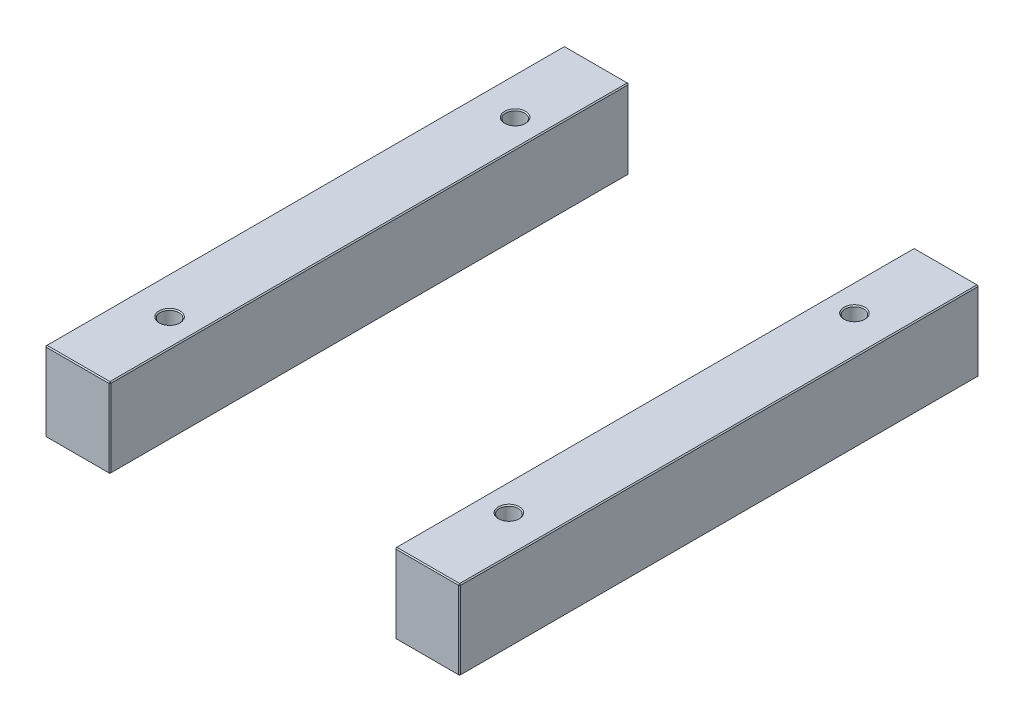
ISO-10303-21;
HEADER;
FILE_DESCRIPTION(('STEP AP214'),'2;1');
FILE_NAME('part.step','',(''),(''),'','','');
FILE_SCHEMA(('AUTOMOTIVE_DESIGN { 1 0 10303 214 1 1 1 1 }'));
ENDSEC;
DATA;
#1=APPLICATION_CONTEXT('core data for automotive mechanical design processes');
#2=APPLICATION_PROTOCOL_DEFINITION('international standard','automotive_design',2000,#1);
#3=PRODUCT_CONTEXT('',#1,'mechanical');
#4=PRODUCT('Part','Part','',(#3));
#5=PRODUCT_RELATED_PRODUCT_CATEGORY('part','',(#4));
#6=PRODUCT_DEFINITION_FORMATION('','',#4);
#7=PRODUCT_DEFINITION_CONTEXT('part definition',#1,'design');
#8=PRODUCT_DEFINITION('design','',#6,#7);
#9=PRODUCT_DEFINITION_SHAPE('','',#8);
#10=(LENGTH_UNIT() NAMED_UNIT(*) SI_UNIT(.MILLI.,.METRE.));
#11=(NAMED_UNIT(*) PLANE_ANGLE_UNIT() SI_UNIT($,.RADIAN.));
#12=(NAMED_UNIT(*) SI_UNIT($,.STERADIAN.) SOLID_ANGLE_UNIT());
#13=UNCERTAINTY_MEASURE_WITH_UNIT(LENGTH_MEASURE(1.E-05),#10,'distance_accuracy_value','');
#14=(GEOMETRIC_REPRESENTATION_CONTEXT(3) GLOBAL_UNCERTAINTY_ASSIGNED_CONTEXT((#13)) GLOBAL_UNIT_ASSIGNED_CONTEXT((#10,
#11,#12)) REPRESENTATION_CONTEXT('',''));
#15=CARTESIAN_POINT('',(0.,0.,0.));
#16=DIRECTION('',(0.,0.,1.));
#17=DIRECTION('',(1.,0.,0.));
#18=AXIS2_PLACEMENT_3D('',#15,#16,#17);
#19=CARTESIAN_POINT('',(-198.,76.,-248.));
#20=DIRECTION('',(0.,0.,1.));
#21=DIRECTION('',(1.,0.,0.));
#22=AXIS2_PLACEMENT_3D('',#19,#20,#21);
#23=PLANE('',#22);
#24=DIRECTION('',(-1.,0.,0.));
#25=VECTOR('',#24,1.);
#26=CARTESIAN_POINT('',(-198.,1.00000000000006,-248.));
#27=LINE('',#26,#25);
#28=CARTESIAN_POINT('',(-137.,1.00000000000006,-248.));
#29=VERTEX_POINT('',#28);
#30=CARTESIAN_POINT('',(-197.,1.00000000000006,-248.));
#31=VERTEX_POINT('',#30);
#32=EDGE_CURVE('P0_E137',#29,#31,#27,.T.);
#33=ORIENTED_EDGE('',*,*,#32,.T.);
#34=DIRECTION('',(0.,1.,0.));
#35=VECTOR('',#34,1.);
#36=CARTESIAN_POINT('',(-197.,76.,-248.));
#37=LINE('',#36,#35);
#38=CARTESIAN_POINT('',(-197.,75.,-248.));
#39=VERTEX_POINT('',#38);
#40=EDGE_CURVE('P0_E235',#31,#39,#37,.T.);
#41=ORIENTED_EDGE('',*,*,#40,.T.);
#42=DIRECTION('',(1.,0.,0.));
#43=VECTOR('',#42,1.);
#44=CARTESIAN_POINT('',(-198.,75.,-248.));
#45=LINE('',#44,#43);
#46=CARTESIAN_POINT('',(-137.,75.,-248.));
#47=VERTEX_POINT('',#46);
#48=EDGE_CURVE('P0_E233',#39,#47,#45,.T.);
#49=ORIENTED_EDGE('',*,*,#48,.T.);
#50=DIRECTION('',(0.,-1.,0.));
#51=VECTOR('',#50,1.);
#52=CARTESIAN_POINT('',(-137.,76.,-248.));
#53=LINE('',#52,#51);
#54=EDGE_CURVE('P0_E230',#47,#29,#53,.T.);
#55=ORIENTED_EDGE('',*,*,#54,.T.);
#56=EDGE_LOOP('',(#33,#41,#49,#55));
#57=FACE_BOUND('',#56,.T.);
#58=ADVANCED_FACE('P0_F16',(#57),#23,.F.);
#59=CARTESIAN_POINT('',(-198.,76.,248.));
#60=DIRECTION('',(1.,0.,0.));
#61=DIRECTION('',(0.,0.,-1.));
#62=AXIS2_PLACEMENT_3D('',#59,#60,#61);
#63=PLANE('',#62);
#64=DIRECTION('',(0.,1.,0.));
#65=VECTOR('',#64,1.);
#66=CARTESIAN_POINT('',(-198.,76.,247.));
#67=LINE('',#66,#65);
#68=CARTESIAN_POINT('',(-198.,1.00000000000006,247.));
#69=VERTEX_POINT('',#68);
#70=CARTESIAN_POINT('',(-198.,75.,247.));
#71=VERTEX_POINT('',#70);
#72=EDGE_CURVE('P0_E217',#69,#71,#67,.T.);
#73=ORIENTED_EDGE('',*,*,#72,.T.);
#74=DIRECTION('',(0.,0.,-1.));
#75=VECTOR('',#74,1.);
#76=CARTESIAN_POINT('',(-198.,75.,248.));
#77=LINE('',#76,#75);
#78=CARTESIAN_POINT('',(-198.,75.,-247.));
#79=VERTEX_POINT('',#78);
#80=EDGE_CURVE('P0_E228',#71,#79,#77,.T.);
#81=ORIENTED_EDGE('',*,*,#80,.T.);
#82=DIRECTION('',(0.,-1.,0.));
#83=VECTOR('',#82,1.);
#84=CARTESIAN_POINT('',(-198.,76.,-247.));
#85=LINE('',#84,#83);
#86=CARTESIAN_POINT('',(-198.,1.00000000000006,-247.));
#87=VERTEX_POINT('',#86);
#88=EDGE_CURVE('P0_E225',#79,#87,#85,.T.);
#89=ORIENTED_EDGE('',*,*,#88,.T.);
#90=DIRECTION('',(0.,0.,1.));
#91=VECTOR('',#90,1.);
#92=CARTESIAN_POINT('',(-198.,1.00000000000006,248.));
#93=LINE('',#92,#91);
#94=EDGE_CURVE('P0_E214',#87,#69,#93,.T.);
#95=ORIENTED_EDGE('',*,*,#94,.T.);
#96=EDGE_LOOP('',(#73,#81,#89,#95));
#97=FACE_BOUND('',#96,.T.);
#98=ADVANCED_FACE('P0_F302',(#97),#63,.F.);
#99=CARTESIAN_POINT('',(-198.,76.,248.));
#100=DIRECTION('',(0.,0.,-1.));
#101=DIRECTION('',(-1.,0.,0.));
#102=AXIS2_PLACEMENT_3D('',#99,#100,#101);
#103=PLANE('',#102);
#104=DIRECTION('',(-1.,0.,0.));
#105=VECTOR('',#104,1.);
#106=CARTESIAN_POINT('',(-198.,75.,248.));
#107=LINE('',#106,#105);
#108=CARTESIAN_POINT('',(-137.,75.,248.));
#109=VERTEX_POINT('',#108);
#110=CARTESIAN_POINT('',(-197.,75.,248.));
#111=VERTEX_POINT('',#110);
#112=EDGE_CURVE('P0_E242',#109,#111,#107,.T.);
#113=ORIENTED_EDGE('',*,*,#112,.T.);
#114=DIRECTION('',(0.,-1.,0.));
#115=VECTOR('',#114,1.);
#116=CARTESIAN_POINT('',(-197.,76.,248.));
#117=LINE('',#116,#115);
#118=CARTESIAN_POINT('',(-197.,1.00000000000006,248.));
#119=VERTEX_POINT('',#118);
#120=EDGE_CURVE('P0_E244',#111,#119,#117,.T.);
#121=ORIENTED_EDGE('',*,*,#120,.T.);
#122=DIRECTION('',(1.,0.,0.));
#123=VECTOR('',#122,1.);
#124=CARTESIAN_POINT('',(-136.,1.00000000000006,248.));
#125=LINE('',#124,#123);
#126=CARTESIAN_POINT('',(-137.,1.00000000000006,248.));
#127=VERTEX_POINT('',#126);
#128=EDGE_CURVE('P0_E240',#119,#127,#125,.T.);
#129=ORIENTED_EDGE('',*,*,#128,.T.);
#130=DIRECTION('',(0.,1.,0.));
#131=VECTOR('',#130,1.);
#132=CARTESIAN_POINT('',(-137.,76.,248.));
#133=LINE('',#132,#131);
#134=EDGE_CURVE('P0_E238',#127,#109,#133,.T.);
#135=ORIENTED_EDGE('',*,*,#134,.T.);
#136=EDGE_LOOP('',(#113,#121,#129,#135));
#137=FACE_BOUND('',#136,.T.);
#138=ADVANCED_FACE('P0_F341',(#137),#103,.F.);
#139=CARTESIAN_POINT('',(-136.,76.,-248.));
#140=DIRECTION('',(-1.,0.,0.));
#141=DIRECTION('',(0.,0.,1.));
#142=AXIS2_PLACEMENT_3D('',#139,#140,#141);
#143=PLANE('',#142);
#144=DIRECTION('',(0.,0.,1.));
#145=VECTOR('',#144,1.);
#146=CARTESIAN_POINT('',(-136.,75.,-248.));
#147=LINE('',#146,#145);
#148=CARTESIAN_POINT('',(-136.,75.,-247.));
#149=VERTEX_POINT('',#148);
#150=CARTESIAN_POINT('',(-136.,75.,247.));
#151=VERTEX_POINT('',#150);
#152=EDGE_CURVE('P0_E31',#149,#151,#147,.T.);
#153=ORIENTED_EDGE('',*,*,#152,.T.);
#154=DIRECTION('',(0.,-1.,0.));
#155=VECTOR('',#154,1.);
#156=CARTESIAN_POINT('',(-136.,76.,247.));
#157=LINE('',#156,#155);
#158=CARTESIAN_POINT('',(-136.,1.00000000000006,247.));
#159=VERTEX_POINT('',#158);
#160=EDGE_CURVE('P0_E190',#151,#159,#157,.T.);
#161=ORIENTED_EDGE('',*,*,#160,.T.);
#162=DIRECTION('',(0.,0.,-1.));
#163=VECTOR('',#162,1.);
#164=CARTESIAN_POINT('',(-136.,1.00000000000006,-248.));
#165=LINE('',#164,#163);
#166=CARTESIAN_POINT('',(-136.,1.00000000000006,-247.));
#167=VERTEX_POINT('',#166);
#168=EDGE_CURVE('P0_E256',#159,#167,#165,.T.);
#169=ORIENTED_EDGE('',*,*,#168,.T.);
#170=DIRECTION('',(0.,1.,0.));
#171=VECTOR('',#170,1.);
#172=CARTESIAN_POINT('',(-136.,76.,-247.));
#173=LINE('',#172,#171);
#174=EDGE_CURVE('P0_E36',#167,#149,#173,.T.);
#175=ORIENTED_EDGE('',*,*,#174,.T.);
#176=EDGE_LOOP('',(#153,#161,#169,#175));
#177=FACE_BOUND('',#176,.T.);
#178=ADVANCED_FACE('P0_F535',(#177),#143,.F.);
#179=CARTESIAN_POINT('',(0.,76.,0.));
#180=DIRECTION('',(0.,-1.,0.));
#181=DIRECTION('',(0.,0.,-1.));
#182=AXIS2_PLACEMENT_3D('',#179,#180,#181);
#183=PLANE('',#182);
#184=CARTESIAN_POINT('',(-162.,76.,165.));
#185=DIRECTION('',(0.,-1.,0.));
#186=DIRECTION('',(0.,0.,-1.));
#187=AXIS2_PLACEMENT_3D('',#184,#185,#186);
#188=CIRCLE('',#187,10.);
#189=CARTESIAN_POINT('',(-162.,76.,155.));
#190=VERTEX_POINT('',#189);
#191=EDGE_CURVE('P0_E24',#190,#190,#188,.T.);
#192=ORIENTED_EDGE('',*,*,#191,.T.);
#193=EDGE_LOOP('',(#192));
#194=FACE_BOUND('',#193,.T.);
#195=CARTESIAN_POINT('',(-162.,76.,-165.));
#196=DIRECTION('',(0.,-1.,0.));
#197=DIRECTION('',(0.,0.,-1.));
#198=AXIS2_PLACEMENT_3D('',#195,#196,#197);
#199=CIRCLE('',#198,10.);
#200=CARTESIAN_POINT('',(-162.,76.,-175.));
#201=VERTEX_POINT('',#200);
#202=EDGE_CURVE('P0_E189',#201,#201,#199,.T.);
#203=ORIENTED_EDGE('',*,*,#202,.T.);
#204=EDGE_LOOP('',(#203));
#205=FACE_BOUND('',#204,.T.);
#206=DIRECTION('',(0.,0.,1.));
#207=VECTOR('',#206,1.);
#208=CARTESIAN_POINT('',(-197.,76.,0.));
#209=LINE('',#208,#207);
#210=CARTESIAN_POINT('',(-197.,76.,-247.));
#211=VERTEX_POINT('',#210);
#212=CARTESIAN_POINT('',(-197.,76.,247.));
#213=VERTEX_POINT('',#212);
#214=EDGE_CURVE('P0_E251',#211,#213,#209,.T.);
#215=ORIENTED_EDGE('',*,*,#214,.T.);
#216=DIRECTION('',(1.,0.,0.));
#217=VECTOR('',#216,1.);
#218=CARTESIAN_POINT('',(0.,76.,247.));
#219=LINE('',#218,#217);
#220=CARTESIAN_POINT('',(-137.,76.,247.));
#221=VERTEX_POINT('',#220);
#222=EDGE_CURVE('P0_E253',#213,#221,#219,.T.);
#223=ORIENTED_EDGE('',*,*,#222,.T.);
#224=DIRECTION('',(0.,0.,-1.));
#225=VECTOR('',#224,1.);
#226=CARTESIAN_POINT('',(-137.,76.,0.));
#227=LINE('',#226,#225);
#228=CARTESIAN_POINT('',(-137.,76.,-247.));
#229=VERTEX_POINT('',#228);
#230=EDGE_CURVE('P0_E247',#221,#229,#227,.T.);
#231=ORIENTED_EDGE('',*,*,#230,.T.);
#232=DIRECTION('',(-1.,0.,0.));
#233=VECTOR('',#232,1.);
#234=CARTESIAN_POINT('',(0.,76.,-247.));
#235=LINE('',#234,#233);
#236=EDGE_CURVE('P0_E249',#229,#211,#235,.T.);
#237=ORIENTED_EDGE('',*,*,#236,.T.);
#238=EDGE_LOOP('',(#215,#223,#231,#237));
#239=FACE_BOUND('',#238,.T.);
#240=ADVANCED_FACE('P0_F195',(#194,#205,#239),#183,.F.);
#241=CARTESIAN_POINT('',(0.,0.,0.));
#242=DIRECTION('',(0.,-1.,0.));
#243=DIRECTION('',(0.,0.,-1.));
#244=AXIS2_PLACEMENT_3D('',#241,#242,#243);
#245=PLANE('',#244);
#246=CARTESIAN_POINT('',(-162.,0.,-165.));
#247=DIRECTION('',(0.,-1.,0.));
#248=DIRECTION('',(0.,0.,-1.));
#249=AXIS2_PLACEMENT_3D('',#246,#247,#248);
#250=CIRCLE('',#249,10.);
#251=CARTESIAN_POINT('',(-162.,0.,-175.));
#252=VERTEX_POINT('',#251);
#253=EDGE_CURVE('P0_E220',#252,#252,#250,.F.);
#254=ORIENTED_EDGE('',*,*,#253,.T.);
#255=EDGE_LOOP('',(#254));
#256=FACE_BOUND('',#255,.T.);
#257=CARTESIAN_POINT('',(-162.,0.,165.));
#258=DIRECTION('',(0.,-1.,0.));
#259=DIRECTION('',(0.,0.,-1.));
#260=AXIS2_PLACEMENT_3D('',#257,#258,#259);
#261=CIRCLE('',#260,10.);
#262=CARTESIAN_POINT('',(-162.,0.,155.));
#263=VERTEX_POINT('',#262);
#264=EDGE_CURVE('P0_E608',#263,#263,#261,.F.);
#265=ORIENTED_EDGE('',*,*,#264,.T.);
#266=EDGE_LOOP('',(#265));
#267=FACE_BOUND('',#266,.T.);
#268=DIRECTION('',(-1.,0.,0.));
#269=VECTOR('',#268,1.);
#270=CARTESIAN_POINT('',(-198.,0.,247.));
#271=LINE('',#270,#269);
#272=CARTESIAN_POINT('',(-137.,0.,247.));
#273=VERTEX_POINT('',#272);
#274=CARTESIAN_POINT('',(-197.,0.,247.));
#275=VERTEX_POINT('',#274);
#276=EDGE_CURVE('P0_E114',#273,#275,#271,.T.);
#277=ORIENTED_EDGE('',*,*,#276,.T.);
#278=DIRECTION('',(0.,0.,-1.));
#279=VECTOR('',#278,1.);
#280=CARTESIAN_POINT('',(-197.,0.,-248.));
#281=LINE('',#280,#279);
#282=CARTESIAN_POINT('',(-197.,0.,-247.));
#283=VERTEX_POINT('',#282);
#284=EDGE_CURVE('P0_E110',#275,#283,#281,.T.);
#285=ORIENTED_EDGE('',*,*,#284,.T.);
#286=DIRECTION('',(1.,0.,0.));
#287=VECTOR('',#286,1.);
#288=CARTESIAN_POINT('',(-136.,0.,-247.));
#289=LINE('',#288,#287);
#290=CARTESIAN_POINT('',(-137.,0.,-247.));
#291=VERTEX_POINT('',#290);
#292=EDGE_CURVE('P0_E104',#283,#291,#289,.T.);
#293=ORIENTED_EDGE('',*,*,#292,.T.);
#294=DIRECTION('',(0.,0.,1.));
#295=VECTOR('',#294,1.);
#296=CARTESIAN_POINT('',(-137.,0.,248.));
#297=LINE('',#296,#295);
#298=EDGE_CURVE('P0_E107',#291,#273,#297,.T.);
#299=ORIENTED_EDGE('',*,*,#298,.T.);
#300=EDGE_LOOP('',(#277,#285,#293,#299));
#301=FACE_BOUND('',#300,.T.);
#302=ADVANCED_FACE('P0_F106',(#256,#267,#301),#245,.T.);
#303=CARTESIAN_POINT('',(-162.,0.,-165.));
#304=DIRECTION('',(0.,1.,0.));
#305=DIRECTION('',(0.,0.,1.));
#306=AXIS2_PLACEMENT_3D('',#303,#304,#305);
#307=CYLINDRICAL_SURFACE('',#306,9.);
#308=CARTESIAN_POINT('',(-162.,75.,-165.));
#309=DIRECTION('',(0.,-1.,0.));
#310=DIRECTION('',(0.,0.,-1.));
#311=AXIS2_PLACEMENT_3D('',#308,#309,#310);
#312=CIRCLE('',#311,9.);
#313=CARTESIAN_POINT('',(-162.,75.,-174.));
#314=VERTEX_POINT('',#313);
#315=EDGE_CURVE('P0_E10',#314,#314,#312,.F.);
#316=ORIENTED_EDGE('',*,*,#315,.T.);
#317=EDGE_LOOP('',(#316));
#318=FACE_BOUND('',#317,.T.);
#319=CARTESIAN_POINT('',(-162.,0.999999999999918,-165.));
#320=DIRECTION('',(0.,-1.,0.));
#321=DIRECTION('',(0.,0.,-1.));
#322=AXIS2_PLACEMENT_3D('',#319,#320,#321);
#323=CIRCLE('',#322,9.);
#324=CARTESIAN_POINT('',(-162.,0.999999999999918,-174.));
#325=VERTEX_POINT('',#324);
#326=EDGE_CURVE('P0_E215',#325,#325,#323,.T.);
#327=ORIENTED_EDGE('',*,*,#326,.T.);
#328=EDGE_LOOP('',(#327));
#329=FACE_BOUND('',#328,.T.);
#330=ADVANCED_FACE('P0_F208',(#318,#329),#307,.F.);
#331=CARTESIAN_POINT('',(-162.,0.,165.));
#332=DIRECTION('',(0.,1.,0.));
#333=DIRECTION('',(0.,0.,1.));
#334=AXIS2_PLACEMENT_3D('',#331,#332,#333);
#335=CYLINDRICAL_SURFACE('',#334,9.);
#336=CARTESIAN_POINT('',(-162.,75.,165.));
#337=DIRECTION('',(0.,-1.,0.));
#338=DIRECTION('',(0.,0.,-1.));
#339=AXIS2_PLACEMENT_3D('',#336,#337,#338);
#340=CIRCLE('',#339,9.);
#341=CARTESIAN_POINT('',(-162.,75.,156.));
#342=VERTEX_POINT('',#341);
#343=EDGE_CURVE('P0_E186',#342,#342,#340,.F.);
#344=ORIENTED_EDGE('',*,*,#343,.T.);
#345=EDGE_LOOP('',(#344));
#346=FACE_BOUND('',#345,.T.);
#347=CARTESIAN_POINT('',(-162.,0.999999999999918,165.));
#348=DIRECTION('',(0.,-1.,0.));
#349=DIRECTION('',(0.,0.,-1.));
#350=AXIS2_PLACEMENT_3D('',#347,#348,#349);
#351=CIRCLE('',#350,9.);
#352=CARTESIAN_POINT('',(-162.,0.999999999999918,156.));
#353=VERTEX_POINT('',#352);
#354=EDGE_CURVE('P0_E212',#353,#353,#351,.T.);
#355=ORIENTED_EDGE('',*,*,#354,.T.);
#356=EDGE_LOOP('',(#355));
#357=FACE_BOUND('',#356,.T.);
#358=ADVANCED_FACE('P0_F204',(#346,#357),#335,.F.);
#359=CARTESIAN_POINT('',(-162.,0.,-165.));
#360=DIRECTION('',(0.,-1.,0.));
#361=DIRECTION('',(0.,0.,-1.));
#362=AXIS2_PLACEMENT_3D('',#359,#360,#361);
#363=CONICAL_SURFACE('',#362,10.,0.785398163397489);
#364=ORIENTED_EDGE('',*,*,#326,.F.);
#365=EDGE_LOOP('',(#364));
#366=FACE_BOUND('',#365,.T.);
#367=ORIENTED_EDGE('',*,*,#253,.F.);
#368=EDGE_LOOP('',(#367));
#369=FACE_BOUND('',#368,.T.);
#370=ADVANCED_FACE('P0_F207',(#366,#369),#363,.F.);
#371=CARTESIAN_POINT('',(-162.,0.,165.));
#372=DIRECTION('',(0.,-1.,0.));
#373=DIRECTION('',(0.,0.,-1.));
#374=AXIS2_PLACEMENT_3D('',#371,#372,#373);
#375=CONICAL_SURFACE('',#374,10.,0.785398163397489);
#376=ORIENTED_EDGE('',*,*,#354,.F.);
#377=EDGE_LOOP('',(#376));
#378=FACE_BOUND('',#377,.T.);
#379=ORIENTED_EDGE('',*,*,#264,.F.);
#380=EDGE_LOOP('',(#379));
#381=FACE_BOUND('',#380,.T.);
#382=ADVANCED_FACE('P0_F347',(#378,#381),#375,.F.);
#383=CARTESIAN_POINT('',(-136.,76.,247.));
#384=DIRECTION('',(-0.707106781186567,0.,-0.707106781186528));
#385=DIRECTION('',(0.,-1.,0.));
#386=AXIS2_PLACEMENT_3D('',#383,#384,#385);
#387=PLANE('',#386);
#388=DIRECTION('',(-0.707106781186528,0.,0.707106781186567));
#389=VECTOR('',#388,1.);
#390=CARTESIAN_POINT('',(-136.5,75.,247.5));
#391=LINE('',#390,#389);
#392=EDGE_CURVE('P0_E125',#109,#151,#391,.F.);
#393=ORIENTED_EDGE('',*,*,#392,.F.);
#394=ORIENTED_EDGE('',*,*,#134,.F.);
#395=DIRECTION('',(0.707106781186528,0.,-0.707106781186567));
#396=VECTOR('',#395,1.);
#397=CARTESIAN_POINT('',(-137.,1.00000000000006,248.));
#398=LINE('',#397,#396);
#399=EDGE_CURVE('P0_E181',#159,#127,#398,.F.);
#400=ORIENTED_EDGE('',*,*,#399,.F.);
#401=ORIENTED_EDGE('',*,*,#160,.F.);
#402=EDGE_LOOP('',(#393,#394,#400,#401));
#403=FACE_BOUND('',#402,.T.);
#404=ADVANCED_FACE('P0_F351',(#403),#387,.F.);
#405=CARTESIAN_POINT('',(-137.,76.,247.));
#406=DIRECTION('',(0.577350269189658,0.577350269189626,0.577350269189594));
#407=DIRECTION('',(-0.707106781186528,0.707106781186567,0.));
#408=AXIS2_PLACEMENT_3D('',#405,#406,#407);
#409=PLANE('',#408);
#410=DIRECTION('',(0.,0.707106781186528,-0.707106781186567));
#411=VECTOR('',#410,1.);
#412=CARTESIAN_POINT('',(-137.,76.,247.));
#413=LINE('',#412,#411);
#414=EDGE_CURVE('P0_E175',#109,#221,#413,.T.);
#415=ORIENTED_EDGE('',*,*,#414,.F.);
#416=ORIENTED_EDGE('',*,*,#392,.T.);
#417=DIRECTION('',(0.707106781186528,-0.707106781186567,0.));
#418=VECTOR('',#417,1.);
#419=CARTESIAN_POINT('',(-137.,76.,247.));
#420=LINE('',#419,#418);
#421=EDGE_CURVE('P0_E178',#221,#151,#420,.T.);
#422=ORIENTED_EDGE('',*,*,#421,.F.);
#423=EDGE_LOOP('',(#415,#416,#422));
#424=FACE_BOUND('',#423,.T.);
#425=ADVANCED_FACE('P0_F487',(#424),#409,.T.);
#426=CARTESIAN_POINT('',(-137.,1.00000000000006,248.));
#427=DIRECTION('',(0.577350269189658,-0.577350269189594,0.577350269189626));
#428=DIRECTION('',(0.707106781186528,0.,-0.707106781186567));
#429=AXIS2_PLACEMENT_3D('',#426,#427,#428);
#430=PLANE('',#429);
#431=DIRECTION('',(0.707106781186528,0.707106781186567,0.));
#432=VECTOR('',#431,1.);
#433=CARTESIAN_POINT('',(-136.5,0.500000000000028,247.));
#434=LINE('',#433,#432);
#435=EDGE_CURVE('P0_E123',#159,#273,#434,.F.);
#436=ORIENTED_EDGE('',*,*,#435,.F.);
#437=ORIENTED_EDGE('',*,*,#399,.T.);
#438=DIRECTION('',(0.,-0.707106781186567,-0.707106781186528));
#439=VECTOR('',#438,1.);
#440=CARTESIAN_POINT('',(-137.,1.00000000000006,248.));
#441=LINE('',#440,#439);
#442=EDGE_CURVE('P0_E172',#273,#127,#441,.F.);
#443=ORIENTED_EDGE('',*,*,#442,.F.);
#444=EDGE_LOOP('',(#436,#437,#443));
#445=FACE_BOUND('',#444,.T.);
#446=ADVANCED_FACE('P0_F478',(#445),#430,.T.);
#447=CARTESIAN_POINT('',(-137.,76.,0.));
#448=DIRECTION('',(-0.707106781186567,-0.707106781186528,0.));
#449=DIRECTION('',(0.,0.,-1.));
#450=AXIS2_PLACEMENT_3D('',#447,#448,#449);
#451=PLANE('',#450);
#452=ORIENTED_EDGE('',*,*,#421,.T.);
#453=ORIENTED_EDGE('',*,*,#152,.F.);
#454=DIRECTION('',(-0.707106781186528,0.707106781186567,0.));
#455=VECTOR('',#454,1.);
#456=CARTESIAN_POINT('',(-136.5,75.5,-247.));
#457=LINE('',#456,#455);
#458=EDGE_CURVE('P0_E165',#229,#149,#457,.F.);
#459=ORIENTED_EDGE('',*,*,#458,.F.);
#460=ORIENTED_EDGE('',*,*,#230,.F.);
#461=EDGE_LOOP('',(#452,#453,#459,#460));
#462=FACE_BOUND('',#461,.T.);
#463=ADVANCED_FACE('P0_F318',(#462),#451,.F.);
#464=CARTESIAN_POINT('',(0.,76.,247.));
#465=DIRECTION('',(0.,-0.707106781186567,-0.707106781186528));
#466=DIRECTION('',(1.,0.,0.));
#467=AXIS2_PLACEMENT_3D('',#464,#465,#466);
#468=PLANE('',#467);
#469=ORIENTED_EDGE('',*,*,#414,.T.);
#470=ORIENTED_EDGE('',*,*,#222,.F.);
#471=DIRECTION('',(0.,-0.707106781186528,0.707106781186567));
#472=VECTOR('',#471,1.);
#473=CARTESIAN_POINT('',(-197.,75.5,247.5));
#474=LINE('',#473,#472);
#475=EDGE_CURVE('P0_E162',#111,#213,#474,.F.);
#476=ORIENTED_EDGE('',*,*,#475,.F.);
#477=ORIENTED_EDGE('',*,*,#112,.F.);
#478=EDGE_LOOP('',(#469,#470,#476,#477));
#479=FACE_BOUND('',#478,.T.);
#480=ADVANCED_FACE('P0_F313',(#479),#468,.F.);
#481=CARTESIAN_POINT('',(-197.,76.,248.));
#482=DIRECTION('',(0.707106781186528,0.,-0.707106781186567));
#483=DIRECTION('',(0.,-1.,0.));
#484=AXIS2_PLACEMENT_3D('',#481,#482,#483);
#485=PLANE('',#484);
#486=DIRECTION('',(0.707106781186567,0.,0.707106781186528));
#487=VECTOR('',#486,1.);
#488=CARTESIAN_POINT('',(-197.,1.00000000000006,248.));
#489=LINE('',#488,#487);
#490=EDGE_CURVE('P0_E156',#119,#69,#489,.F.);
#491=ORIENTED_EDGE('',*,*,#490,.F.);
#492=ORIENTED_EDGE('',*,*,#120,.F.);
#493=DIRECTION('',(-0.707106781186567,0.,-0.707106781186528));
#494=VECTOR('',#493,1.);
#495=CARTESIAN_POINT('',(-198.,75.,247.));
#496=LINE('',#495,#494);
#497=EDGE_CURVE('P0_E159',#71,#111,#496,.F.);
#498=ORIENTED_EDGE('',*,*,#497,.F.);
#499=ORIENTED_EDGE('',*,*,#72,.F.);
#500=EDGE_LOOP('',(#491,#492,#498,#499));
#501=FACE_BOUND('',#500,.T.);
#502=ADVANCED_FACE('P0_F307',(#501),#485,.F.);
#503=CARTESIAN_POINT('',(-198.,1.00000000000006,248.));
#504=DIRECTION('',(0.,-0.707106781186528,0.707106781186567));
#505=DIRECTION('',(-1.,0.,0.));
#506=AXIS2_PLACEMENT_3D('',#503,#504,#505);
#507=PLANE('',#506);
#508=ORIENTED_EDGE('',*,*,#442,.T.);
#509=ORIENTED_EDGE('',*,*,#128,.F.);
#510=DIRECTION('',(0.,0.707106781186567,0.707106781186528));
#511=VECTOR('',#510,1.);
#512=CARTESIAN_POINT('',(-197.,1.00000000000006,248.));
#513=LINE('',#512,#511);
#514=EDGE_CURVE('P0_E134',#275,#119,#513,.T.);
#515=ORIENTED_EDGE('',*,*,#514,.F.);
#516=ORIENTED_EDGE('',*,*,#276,.F.);
#517=EDGE_LOOP('',(#508,#509,#515,#516));
#518=FACE_BOUND('',#517,.T.);
#519=ADVANCED_FACE('P0_F333',(#518),#507,.T.);
#520=CARTESIAN_POINT('',(-136.,1.00000000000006,-248.));
#521=DIRECTION('',(0.707106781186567,-0.707106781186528,0.));
#522=DIRECTION('',(0.,0.,1.));
#523=AXIS2_PLACEMENT_3D('',#520,#521,#522);
#524=PLANE('',#523);
#525=ORIENTED_EDGE('',*,*,#435,.T.);
#526=ORIENTED_EDGE('',*,*,#298,.F.);
#527=DIRECTION('',(-0.707106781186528,-0.707106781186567,0.));
#528=VECTOR('',#527,1.);
#529=CARTESIAN_POINT('',(-137.,0.,-247.));
#530=LINE('',#529,#528);
#531=EDGE_CURVE('P0_E120',#167,#291,#530,.T.);
#532=ORIENTED_EDGE('',*,*,#531,.F.);
#533=ORIENTED_EDGE('',*,*,#168,.F.);
#534=EDGE_LOOP('',(#525,#526,#532,#533));
#535=FACE_BOUND('',#534,.T.);
#536=ADVANCED_FACE('P0_F119',(#535),#524,.T.);
#537=CARTESIAN_POINT('',(-137.,76.,-248.));
#538=DIRECTION('',(-0.707106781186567,0.,0.707106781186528));
#539=DIRECTION('',(0.,-1.,0.));
#540=AXIS2_PLACEMENT_3D('',#537,#538,#539);
#541=PLANE('',#540);
#542=DIRECTION('',(0.707106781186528,0.,0.707106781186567));
#543=VECTOR('',#542,1.);
#544=CARTESIAN_POINT('',(-137.,75.,-248.));
#545=LINE('',#544,#543);
#546=EDGE_CURVE('P0_E168',#149,#47,#545,.F.);
#547=ORIENTED_EDGE('',*,*,#546,.F.);
#548=ORIENTED_EDGE('',*,*,#174,.F.);
#549=DIRECTION('',(-0.707106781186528,0.,-0.707106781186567));
#550=VECTOR('',#549,1.);
#551=CARTESIAN_POINT('',(-136.5,1.00000000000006,-247.5));
#552=LINE('',#551,#550);
#553=EDGE_CURVE('P0_E133',#29,#167,#552,.F.);
#554=ORIENTED_EDGE('',*,*,#553,.F.);
#555=ORIENTED_EDGE('',*,*,#54,.F.);
#556=EDGE_LOOP('',(#547,#548,#554,#555));
#557=FACE_BOUND('',#556,.T.);
#558=ADVANCED_FACE('P0_F323',(#557),#541,.F.);
#559=CARTESIAN_POINT('',(-137.,75.,-248.));
#560=DIRECTION('',(0.577350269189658,0.577350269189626,-0.577350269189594));
#561=DIRECTION('',(-0.707106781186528,0.707106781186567,0.));
#562=AXIS2_PLACEMENT_3D('',#559,#560,#561);
#563=PLANE('',#562);
#564=ORIENTED_EDGE('',*,*,#458,.T.);
#565=ORIENTED_EDGE('',*,*,#546,.T.);
#566=DIRECTION('',(0.,-0.707106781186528,-0.707106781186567));
#567=VECTOR('',#566,1.);
#568=CARTESIAN_POINT('',(-137.,75.,-248.));
#569=LINE('',#568,#567);
#570=EDGE_CURVE('P0_E151',#229,#47,#569,.T.);
#571=ORIENTED_EDGE('',*,*,#570,.F.);
#572=EDGE_LOOP('',(#564,#565,#571));
#573=FACE_BOUND('',#572,.T.);
#574=ADVANCED_FACE('P0_F321',(#573),#563,.T.);
#575=CARTESIAN_POINT('',(-198.,75.,247.));
#576=DIRECTION('',(-0.577350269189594,0.577350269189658,0.577350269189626));
#577=DIRECTION('',(0.,-0.707106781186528,0.707106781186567));
#578=AXIS2_PLACEMENT_3D('',#575,#576,#577);
#579=PLANE('',#578);
#580=ORIENTED_EDGE('',*,*,#497,.T.);
#581=ORIENTED_EDGE('',*,*,#475,.T.);
#582=DIRECTION('',(0.707106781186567,0.707106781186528,0.));
#583=VECTOR('',#582,1.);
#584=CARTESIAN_POINT('',(-198.,75.,247.));
#585=LINE('',#584,#583);
#586=EDGE_CURVE('P0_E142',#71,#213,#585,.T.);
#587=ORIENTED_EDGE('',*,*,#586,.F.);
#588=EDGE_LOOP('',(#580,#581,#587));
#589=FACE_BOUND('',#588,.T.);
#590=ADVANCED_FACE('P0_F310',(#589),#579,.T.);
#591=CARTESIAN_POINT('',(-197.,1.00000000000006,248.));
#592=DIRECTION('',(-0.577350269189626,-0.577350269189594,0.577350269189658));
#593=DIRECTION('',(0.707106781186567,0.,0.707106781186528));
#594=AXIS2_PLACEMENT_3D('',#591,#592,#593);
#595=PLANE('',#594);
#596=ORIENTED_EDGE('',*,*,#514,.T.);
#597=ORIENTED_EDGE('',*,*,#490,.T.);
#598=DIRECTION('',(0.707106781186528,-0.707106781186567,0.));
#599=VECTOR('',#598,1.);
#600=CARTESIAN_POINT('',(-197.5,0.500000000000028,247.));
#601=LINE('',#600,#599);
#602=EDGE_CURVE('P0_E138',#275,#69,#601,.F.);
#603=ORIENTED_EDGE('',*,*,#602,.F.);
#604=EDGE_LOOP('',(#596,#597,#603));
#605=FACE_BOUND('',#604,.T.);
#606=ADVANCED_FACE('P0_F368',(#605),#595,.T.);
#607=CARTESIAN_POINT('',(-137.,0.,-247.));
#608=DIRECTION('',(0.577350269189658,-0.577350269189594,-0.577350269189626));
#609=DIRECTION('',(-0.707106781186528,0.,-0.707106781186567));
#610=AXIS2_PLACEMENT_3D('',#607,#608,#609);
#611=PLANE('',#610);
#612=ORIENTED_EDGE('',*,*,#553,.T.);
#613=ORIENTED_EDGE('',*,*,#531,.T.);
#614=DIRECTION('',(0.,0.707106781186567,-0.707106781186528));
#615=VECTOR('',#614,1.);
#616=CARTESIAN_POINT('',(-137.,0.,-247.));
#617=LINE('',#616,#615);
#618=EDGE_CURVE('P0_E130',#29,#291,#617,.F.);
#619=ORIENTED_EDGE('',*,*,#618,.F.);
#620=EDGE_LOOP('',(#612,#613,#619));
#621=FACE_BOUND('',#620,.T.);
#622=ADVANCED_FACE('P0_F129',(#621),#611,.T.);
#623=CARTESIAN_POINT('',(0.,76.,-247.));
#624=DIRECTION('',(0.,-0.707106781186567,0.707106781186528));
#625=DIRECTION('',(-1.,0.,0.));
#626=AXIS2_PLACEMENT_3D('',#623,#624,#625);
#627=PLANE('',#626);
#628=ORIENTED_EDGE('',*,*,#570,.T.);
#629=ORIENTED_EDGE('',*,*,#48,.F.);
#630=DIRECTION('',(0.,0.707106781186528,0.707106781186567));
#631=VECTOR('',#630,1.);
#632=CARTESIAN_POINT('',(-197.,75.,-248.));
#633=LINE('',#632,#631);
#634=EDGE_CURVE('P0_E139',#211,#39,#633,.F.);
#635=ORIENTED_EDGE('',*,*,#634,.F.);
#636=ORIENTED_EDGE('',*,*,#236,.F.);
#637=EDGE_LOOP('',(#628,#629,#635,#636));
#638=FACE_BOUND('',#637,.T.);
#639=ADVANCED_FACE('P0_F286',(#638),#627,.F.);
#640=CARTESIAN_POINT('',(-197.,76.,0.));
#641=DIRECTION('',(0.707106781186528,-0.707106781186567,0.));
#642=DIRECTION('',(0.,0.,1.));
#643=AXIS2_PLACEMENT_3D('',#640,#641,#642);
#644=PLANE('',#643);
#645=ORIENTED_EDGE('',*,*,#586,.T.);
#646=ORIENTED_EDGE('',*,*,#214,.F.);
#647=DIRECTION('',(-0.707106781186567,-0.707106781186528,0.));
#648=VECTOR('',#647,1.);
#649=CARTESIAN_POINT('',(-197.5,75.5,-247.));
#650=LINE('',#649,#648);
#651=EDGE_CURVE('P0_E145',#79,#211,#650,.F.);
#652=ORIENTED_EDGE('',*,*,#651,.F.);
#653=ORIENTED_EDGE('',*,*,#80,.F.);
#654=EDGE_LOOP('',(#645,#646,#652,#653));
#655=FACE_BOUND('',#654,.T.);
#656=ADVANCED_FACE('P0_F280',(#655),#644,.F.);
#657=CARTESIAN_POINT('',(-198.,1.00000000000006,248.));
#658=DIRECTION('',(-0.707106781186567,-0.707106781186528,0.));
#659=DIRECTION('',(0.,0.,-1.));
#660=AXIS2_PLACEMENT_3D('',#657,#658,#659);
#661=PLANE('',#660);
#662=ORIENTED_EDGE('',*,*,#602,.T.);
#663=ORIENTED_EDGE('',*,*,#94,.F.);
#664=DIRECTION('',(-0.707106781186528,0.707106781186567,0.));
#665=VECTOR('',#664,1.);
#666=CARTESIAN_POINT('',(-198.,1.00000000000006,-247.));
#667=LINE('',#666,#665);
#668=EDGE_CURVE('P0_E267',#283,#87,#667,.T.);
#669=ORIENTED_EDGE('',*,*,#668,.F.);
#670=ORIENTED_EDGE('',*,*,#284,.F.);
#671=EDGE_LOOP('',(#662,#663,#669,#670));
#672=FACE_BOUND('',#671,.T.);
#673=ADVANCED_FACE('P0_F298',(#672),#661,.T.);
#674=CARTESIAN_POINT('',(-198.,1.00000000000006,-248.));
#675=DIRECTION('',(0.,-0.707106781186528,-0.707106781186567));
#676=DIRECTION('',(1.,0.,0.));
#677=AXIS2_PLACEMENT_3D('',#674,#675,#676);
#678=PLANE('',#677);
#679=ORIENTED_EDGE('',*,*,#618,.T.);
#680=ORIENTED_EDGE('',*,*,#292,.F.);
#681=DIRECTION('',(0.,-0.707106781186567,0.707106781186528));
#682=VECTOR('',#681,1.);
#683=CARTESIAN_POINT('',(-197.,0.500000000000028,-247.5));
#684=LINE('',#683,#682);
#685=EDGE_CURVE('P0_E265',#31,#283,#684,.T.);
#686=ORIENTED_EDGE('',*,*,#685,.F.);
#687=ORIENTED_EDGE('',*,*,#32,.F.);
#688=EDGE_LOOP('',(#679,#680,#686,#687));
#689=FACE_BOUND('',#688,.T.);
#690=ADVANCED_FACE('P0_F136',(#689),#678,.T.);
#691=CARTESIAN_POINT('',(-197.,75.,-248.));
#692=DIRECTION('',(-0.577350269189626,0.577350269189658,-0.577350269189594));
#693=DIRECTION('',(-0.707106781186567,-0.707106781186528,0.));
#694=AXIS2_PLACEMENT_3D('',#691,#692,#693);
#695=PLANE('',#694);
#696=ORIENTED_EDGE('',*,*,#651,.T.);
#697=ORIENTED_EDGE('',*,*,#634,.T.);
#698=DIRECTION('',(0.707106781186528,0.,-0.707106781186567));
#699=VECTOR('',#698,1.);
#700=CARTESIAN_POINT('',(-197.,75.,-248.));
#701=LINE('',#700,#699);
#702=EDGE_CURVE('P0_E263',#79,#39,#701,.T.);
#703=ORIENTED_EDGE('',*,*,#702,.F.);
#704=EDGE_LOOP('',(#696,#697,#703));
#705=FACE_BOUND('',#704,.T.);
#706=ADVANCED_FACE('P0_F273',(#705),#695,.T.);
#707=CARTESIAN_POINT('',(-198.,1.00000000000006,-247.));
#708=DIRECTION('',(-0.577350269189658,-0.577350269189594,-0.577350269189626));
#709=DIRECTION('',(-0.707106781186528,0.,0.707106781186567));
#710=AXIS2_PLACEMENT_3D('',#707,#708,#709);
#711=PLANE('',#710);
#712=ORIENTED_EDGE('',*,*,#685,.T.);
#713=ORIENTED_EDGE('',*,*,#668,.T.);
#714=DIRECTION('',(-0.707106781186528,0.,0.707106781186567));
#715=VECTOR('',#714,1.);
#716=CARTESIAN_POINT('',(-198.,1.00000000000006,-247.));
#717=LINE('',#716,#715);
#718=EDGE_CURVE('P0_E261',#31,#87,#717,.T.);
#719=ORIENTED_EDGE('',*,*,#718,.F.);
#720=EDGE_LOOP('',(#712,#713,#719));
#721=FACE_BOUND('',#720,.T.);
#722=ADVANCED_FACE('P0_F294',(#721),#711,.T.);
#723=CARTESIAN_POINT('',(-198.,76.,-247.));
#724=DIRECTION('',(0.707106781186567,0.,0.707106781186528));
#725=DIRECTION('',(0.,-1.,0.));
#726=AXIS2_PLACEMENT_3D('',#723,#724,#725);
#727=PLANE('',#726);
#728=ORIENTED_EDGE('',*,*,#702,.T.);
#729=ORIENTED_EDGE('',*,*,#40,.F.);
#730=ORIENTED_EDGE('',*,*,#718,.T.);
#731=ORIENTED_EDGE('',*,*,#88,.F.);
#732=EDGE_LOOP('',(#728,#729,#730,#731));
#733=FACE_BOUND('',#732,.T.);
#734=ADVANCED_FACE('P0_F201',(#733),#727,.F.);
#735=CARTESIAN_POINT('',(-162.,75.,165.));
#736=DIRECTION('',(0.,1.,0.));
#737=DIRECTION('',(0.,0.,1.));
#738=AXIS2_PLACEMENT_3D('',#735,#736,#737);
#739=CONICAL_SURFACE('',#738,9.,0.785398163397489);
#740=ORIENTED_EDGE('',*,*,#191,.F.);
#741=EDGE_LOOP('',(#740));
#742=FACE_BOUND('',#741,.T.);
#743=ORIENTED_EDGE('',*,*,#343,.F.);
#744=EDGE_LOOP('',(#743));
#745=FACE_BOUND('',#744,.T.);
#746=ADVANCED_FACE('P0_F198',(#742,#745),#739,.F.);
#747=CARTESIAN_POINT('',(-162.,75.,-165.));
#748=DIRECTION('',(0.,1.,0.));
#749=DIRECTION('',(0.,0.,1.));
#750=AXIS2_PLACEMENT_3D('',#747,#748,#749);
#751=CONICAL_SURFACE('',#750,9.,0.785398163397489);
#752=ORIENTED_EDGE('',*,*,#202,.F.);
#753=EDGE_LOOP('',(#752));
#754=FACE_BOUND('',#753,.T.);
#755=ORIENTED_EDGE('',*,*,#315,.F.);
#756=EDGE_LOOP('',(#755));
#757=FACE_BOUND('',#756,.T.);
#758=ADVANCED_FACE('P0_F18',(#754,#757),#751,.F.);
#759=CLOSED_SHELL('',(#58,#98,#138,#178,#240,#302,#330,#358,#370,#382,#404,#425,#446,#463,#480,
#502,#519,#536,#558,#574,#590,#606,#622,#639,#656,#673,#690,#706,#722,#734,#746,#758));
#760=MANIFOLD_SOLID_BREP('P0_B1',#759);
#761=CARTESIAN_POINT('',(198.,76.,248.));
#762=DIRECTION('',(0.,0.,-1.));
#763=DIRECTION('',(-1.,0.,0.));
#764=AXIS2_PLACEMENT_3D('',#761,#762,#763);
#765=PLANE('',#764);
#766=DIRECTION('',(0.,-1.,0.));
#767=VECTOR('',#766,1.);
#768=CARTESIAN_POINT('',(137.,76.,248.));
#769=LINE('',#768,#767);
#770=CARTESIAN_POINT('',(137.,75.,248.));
#771=VERTEX_POINT('',#770);
#772=CARTESIAN_POINT('',(137.,1.00000000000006,248.));
#773=VERTEX_POINT('',#772);
#774=EDGE_CURVE('P1_E174',#771,#773,#769,.T.);
#775=ORIENTED_EDGE('',*,*,#774,.T.);
#776=DIRECTION('',(1.,0.,0.));
#777=VECTOR('',#776,1.);
#778=CARTESIAN_POINT('',(198.,1.00000000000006,248.));
#779=LINE('',#778,#777);
#780=CARTESIAN_POINT('',(197.,1.00000000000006,248.));
#781=VERTEX_POINT('',#780);
#782=EDGE_CURVE('P1_E176',#773,#781,#779,.T.);
#783=ORIENTED_EDGE('',*,*,#782,.T.);
#784=DIRECTION('',(0.,1.,0.));
#785=VECTOR('',#784,1.);
#786=CARTESIAN_POINT('',(197.,76.,248.));
#787=LINE('',#786,#785);
#788=CARTESIAN_POINT('',(197.,75.,248.));
#789=VERTEX_POINT('',#788);
#790=EDGE_CURVE('P1_E172',#781,#789,#787,.T.);
#791=ORIENTED_EDGE('',*,*,#790,.T.);
#792=DIRECTION('',(-1.,0.,0.));
#793=VECTOR('',#792,1.);
#794=CARTESIAN_POINT('',(136.,75.,248.));
#795=LINE('',#794,#793);
#796=EDGE_CURVE('P1_E170',#789,#771,#795,.T.);
#797=ORIENTED_EDGE('',*,*,#796,.T.);
#798=EDGE_LOOP('',(#775,#783,#791,#797));
#799=FACE_BOUND('',#798,.T.);
#800=ADVANCED_FACE('P1_F17',(#799),#765,.F.);
#801=CARTESIAN_POINT('',(198.,76.,248.));
#802=DIRECTION('',(-1.,0.,0.));
#803=DIRECTION('',(0.,0.,1.));
#804=AXIS2_PLACEMENT_3D('',#801,#802,#803);
#805=PLANE('',#804);
#806=DIRECTION('',(0.,0.,1.));
#807=VECTOR('',#806,1.);
#808=CARTESIAN_POINT('',(198.,75.,248.));
#809=LINE('',#808,#807);
#810=CARTESIAN_POINT('',(198.,75.,-247.));
#811=VERTEX_POINT('',#810);
#812=CARTESIAN_POINT('',(198.,75.,247.));
#813=VERTEX_POINT('',#812);
#814=EDGE_CURVE('P1_E188',#811,#813,#809,.T.);
#815=ORIENTED_EDGE('',*,*,#814,.T.);
#816=DIRECTION('',(0.,-1.,0.));
#817=VECTOR('',#816,1.);
#818=CARTESIAN_POINT('',(198.,76.,247.));
#819=LINE('',#818,#817);
#820=CARTESIAN_POINT('',(198.,1.00000000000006,247.));
#821=VERTEX_POINT('',#820);
#822=EDGE_CURVE('P1_E194',#813,#821,#819,.T.);
#823=ORIENTED_EDGE('',*,*,#822,.T.);
#824=DIRECTION('',(0.,0.,-1.));
#825=VECTOR('',#824,1.);
#826=CARTESIAN_POINT('',(198.,1.00000000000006,248.));
#827=LINE('',#826,#825);
#828=CARTESIAN_POINT('',(198.,1.00000000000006,-247.));
#829=VERTEX_POINT('',#828);
#830=EDGE_CURVE('P1_E192',#821,#829,#827,.T.);
#831=ORIENTED_EDGE('',*,*,#830,.T.);
#832=DIRECTION('',(0.,1.,0.));
#833=VECTOR('',#832,1.);
#834=CARTESIAN_POINT('',(198.,76.,-247.));
#835=LINE('',#834,#833);
#836=EDGE_CURVE('P1_E190',#829,#811,#835,.T.);
#837=ORIENTED_EDGE('',*,*,#836,.T.);
#838=EDGE_LOOP('',(#815,#823,#831,#837));
#839=FACE_BOUND('',#838,.T.);
#840=ADVANCED_FACE('P1_F276',(#839),#805,.F.);
#841=CARTESIAN_POINT('',(198.,76.,-248.));
#842=DIRECTION('',(0.,0.,1.));
#843=DIRECTION('',(1.,0.,0.));
#844=AXIS2_PLACEMENT_3D('',#841,#842,#843);
#845=PLANE('',#844);
#846=DIRECTION('',(0.,-1.,0.));
#847=VECTOR('',#846,1.);
#848=CARTESIAN_POINT('',(197.,76.,-248.));
#849=LINE('',#848,#847);
#850=CARTESIAN_POINT('',(197.,75.,-248.));
#851=VERTEX_POINT('',#850);
#852=CARTESIAN_POINT('',(197.,1.00000000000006,-248.));
#853=VERTEX_POINT('',#852);
#854=EDGE_CURVE('P1_E165',#851,#853,#849,.T.);
#855=ORIENTED_EDGE('',*,*,#854,.T.);
#856=DIRECTION('',(-1.,0.,0.));
#857=VECTOR('',#856,1.);
#858=CARTESIAN_POINT('',(198.,1.00000000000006,-248.));
#859=LINE('',#858,#857);
#860=CARTESIAN_POINT('',(137.,1.00000000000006,-248.));
#861=VERTEX_POINT('',#860);
#862=EDGE_CURVE('P1_E113',#853,#861,#859,.T.);
#863=ORIENTED_EDGE('',*,*,#862,.T.);
#864=DIRECTION('',(0.,1.,0.));
#865=VECTOR('',#864,1.);
#866=CARTESIAN_POINT('',(137.,76.,-248.));
#867=LINE('',#866,#865);
#868=CARTESIAN_POINT('',(137.,75.,-248.));
#869=VERTEX_POINT('',#868);
#870=EDGE_CURVE('P1_E167',#861,#869,#867,.T.);
#871=ORIENTED_EDGE('',*,*,#870,.T.);
#872=DIRECTION('',(1.,0.,0.));
#873=VECTOR('',#872,1.);
#874=CARTESIAN_POINT('',(198.,75.,-248.));
#875=LINE('',#874,#873);
#876=EDGE_CURVE('P1_E163',#869,#851,#875,.T.);
#877=ORIENTED_EDGE('',*,*,#876,.T.);
#878=EDGE_LOOP('',(#855,#863,#871,#877));
#879=FACE_BOUND('',#878,.T.);
#880=ADVANCED_FACE('P1_F333',(#879),#845,.F.);
#881=CARTESIAN_POINT('',(136.,76.,-248.));
#882=DIRECTION('',(1.,0.,0.));
#883=DIRECTION('',(0.,0.,-1.));
#884=AXIS2_PLACEMENT_3D('',#881,#882,#883);
#885=PLANE('',#884);
#886=DIRECTION('',(0.,0.,-1.));
#887=VECTOR('',#886,1.);
#888=CARTESIAN_POINT('',(136.,75.,-248.));
#889=LINE('',#888,#887);
#890=CARTESIAN_POINT('',(136.,75.,247.));
#891=VERTEX_POINT('',#890);
#892=CARTESIAN_POINT('',(136.,75.,-247.));
#893=VERTEX_POINT('',#892);
#894=EDGE_CURVE('P1_E179',#891,#893,#889,.T.);
#895=ORIENTED_EDGE('',*,*,#894,.T.);
#896=DIRECTION('',(0.,-1.,0.));
#897=VECTOR('',#896,1.);
#898=CARTESIAN_POINT('',(136.,76.,-247.));
#899=LINE('',#898,#897);
#900=CARTESIAN_POINT('',(136.,1.00000000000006,-247.));
#901=VERTEX_POINT('',#900);
#902=EDGE_CURVE('P1_E185',#893,#901,#899,.T.);
#903=ORIENTED_EDGE('',*,*,#902,.T.);
#904=DIRECTION('',(0.,0.,1.));
#905=VECTOR('',#904,1.);
#906=CARTESIAN_POINT('',(136.,1.00000000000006,-248.));
#907=LINE('',#906,#905);
#908=CARTESIAN_POINT('',(136.,1.00000000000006,247.));
#909=VERTEX_POINT('',#908);
#910=EDGE_CURVE('P1_E183',#901,#909,#907,.T.);
#911=ORIENTED_EDGE('',*,*,#910,.T.);
#912=DIRECTION('',(0.,1.,0.));
#913=VECTOR('',#912,1.);
#914=CARTESIAN_POINT('',(136.,76.,247.));
#915=LINE('',#914,#913);
#916=EDGE_CURVE('P1_E181',#909,#891,#915,.T.);
#917=ORIENTED_EDGE('',*,*,#916,.T.);
#918=EDGE_LOOP('',(#895,#903,#911,#917));
#919=FACE_BOUND('',#918,.T.);
#920=ADVANCED_FACE('P1_F544',(#919),#885,.F.);
#921=CARTESIAN_POINT('',(0.,76.,0.));
#922=DIRECTION('',(0.,1.,0.));
#923=DIRECTION('',(0.,0.,1.));
#924=AXIS2_PLACEMENT_3D('',#921,#922,#923);
#925=PLANE('',#924);
#926=DIRECTION('',(-1.,0.,0.));
#927=VECTOR('',#926,1.);
#928=CARTESIAN_POINT('',(136.,76.,-247.));
#929=LINE('',#928,#927);
#930=CARTESIAN_POINT('',(197.,76.,-247.));
#931=VERTEX_POINT('',#930);
#932=CARTESIAN_POINT('',(137.,76.,-247.));
#933=VERTEX_POINT('',#932);
#934=EDGE_CURVE('P1_E26',#931,#933,#929,.T.);
#935=ORIENTED_EDGE('',*,*,#934,.T.);
#936=DIRECTION('',(0.,0.,1.));
#937=VECTOR('',#936,1.);
#938=CARTESIAN_POINT('',(137.,76.,248.));
#939=LINE('',#938,#937);
#940=CARTESIAN_POINT('',(137.,76.,247.));
#941=VERTEX_POINT('',#940);
#942=EDGE_CURVE('P1_E11',#933,#941,#939,.T.);
#943=ORIENTED_EDGE('',*,*,#942,.T.);
#944=DIRECTION('',(1.,0.,0.));
#945=VECTOR('',#944,1.);
#946=CARTESIAN_POINT('',(198.,76.,247.));
#947=LINE('',#946,#945);
#948=CARTESIAN_POINT('',(197.,76.,247.));
#949=VERTEX_POINT('',#948);
#950=EDGE_CURVE('P1_E203',#941,#949,#947,.T.);
#951=ORIENTED_EDGE('',*,*,#950,.T.);
#952=DIRECTION('',(0.,0.,-1.));
#953=VECTOR('',#952,1.);
#954=CARTESIAN_POINT('',(197.,76.,-248.));
#955=LINE('',#954,#953);
#956=EDGE_CURVE('P1_E37',#949,#931,#955,.T.);
#957=ORIENTED_EDGE('',*,*,#956,.T.);
#958=EDGE_LOOP('',(#935,#943,#951,#957));
#959=FACE_BOUND('',#958,.T.);
#960=CARTESIAN_POINT('',(162.,76.,-165.));
#961=DIRECTION('',(0.,1.,0.));
#962=DIRECTION('',(0.,0.,1.));
#963=AXIS2_PLACEMENT_3D('',#960,#961,#962);
#964=CIRCLE('',#963,10.0000000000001);
#965=CARTESIAN_POINT('',(162.,76.,-155.));
#966=VERTEX_POINT('',#965);
#967=EDGE_CURVE('P1_E200',#966,#966,#964,.F.);
#968=ORIENTED_EDGE('',*,*,#967,.T.);
#969=EDGE_LOOP('',(#968));
#970=FACE_BOUND('',#969,.T.);
#971=CARTESIAN_POINT('',(162.,76.,165.));
#972=DIRECTION('',(0.,1.,0.));
#973=DIRECTION('',(0.,0.,1.));
#974=AXIS2_PLACEMENT_3D('',#971,#972,#973);
#975=CIRCLE('',#974,10.0000000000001);
#976=CARTESIAN_POINT('',(162.,76.,175.));
#977=VERTEX_POINT('',#976);
#978=EDGE_CURVE('P1_E197',#977,#977,#975,.F.);
#979=ORIENTED_EDGE('',*,*,#978,.T.);
#980=EDGE_LOOP('',(#979));
#981=FACE_BOUND('',#980,.T.);
#982=ADVANCED_FACE('P1_F299',(#959,#970,#981),#925,.T.);
#983=CARTESIAN_POINT('',(0.,0.,0.));
#984=DIRECTION('',(0.,1.,0.));
#985=DIRECTION('',(0.,0.,1.));
#986=AXIS2_PLACEMENT_3D('',#983,#984,#985);
#987=PLANE('',#986);
#988=CARTESIAN_POINT('',(162.,0.,-165.));
#989=DIRECTION('',(0.,1.,0.));
#990=DIRECTION('',(0.,0.,1.));
#991=AXIS2_PLACEMENT_3D('',#988,#989,#990);
#992=CIRCLE('',#991,10.);
#993=CARTESIAN_POINT('',(162.,0.,-155.));
#994=VERTEX_POINT('',#993);
#995=EDGE_CURVE('P1_E148',#994,#994,#992,.T.);
#996=ORIENTED_EDGE('',*,*,#995,.T.);
#997=EDGE_LOOP('',(#996));
#998=FACE_BOUND('',#997,.T.);
#999=CARTESIAN_POINT('',(162.,0.,165.));
#1000=DIRECTION('',(0.,1.,0.));
#1001=DIRECTION('',(0.,0.,1.));
#1002=AXIS2_PLACEMENT_3D('',#999,#1000,#1001);
#1003=CIRCLE('',#1002,10.);
#1004=CARTESIAN_POINT('',(162.,0.,175.));
#1005=VERTEX_POINT('',#1004);
#1006=EDGE_CURVE('P1_E142',#1005,#1005,#1003,.T.);
#1007=ORIENTED_EDGE('',*,*,#1006,.T.);
#1008=EDGE_LOOP('',(#1007));
#1009=FACE_BOUND('',#1008,.T.);
#1010=DIRECTION('',(-1.,0.,0.));
#1011=VECTOR('',#1010,1.);
#1012=CARTESIAN_POINT('',(1.10574631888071E-13,0.,247.));
#1013=LINE('',#1012,#1011);
#1014=CARTESIAN_POINT('',(197.,0.,247.));
#1015=VERTEX_POINT('',#1014);
#1016=CARTESIAN_POINT('',(137.,0.,247.));
#1017=VERTEX_POINT('',#1016);
#1018=EDGE_CURVE('P1_E135',#1015,#1017,#1013,.T.);
#1019=ORIENTED_EDGE('',*,*,#1018,.T.);
#1020=DIRECTION('',(0.,0.,-1.));
#1021=VECTOR('',#1020,1.);
#1022=CARTESIAN_POINT('',(137.,0.,0.));
#1023=LINE('',#1022,#1021);
#1024=CARTESIAN_POINT('',(137.,0.,-247.));
#1025=VERTEX_POINT('',#1024);
#1026=EDGE_CURVE('P1_E139',#1017,#1025,#1023,.T.);
#1027=ORIENTED_EDGE('',*,*,#1026,.T.);
#1028=DIRECTION('',(1.,0.,0.));
#1029=VECTOR('',#1028,1.);
#1030=CARTESIAN_POINT('',(-9.95171686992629E-13,0.,-247.));
#1031=LINE('',#1030,#1029);
#1032=CARTESIAN_POINT('',(197.,0.,-247.));
#1033=VERTEX_POINT('',#1032);
#1034=EDGE_CURVE('P1_E110',#1025,#1033,#1031,.T.);
#1035=ORIENTED_EDGE('',*,*,#1034,.T.);
#1036=DIRECTION('',(0.,0.,1.));
#1037=VECTOR('',#1036,1.);
#1038=CARTESIAN_POINT('',(197.,0.,0.));
#1039=LINE('',#1038,#1037);
#1040=EDGE_CURVE('P1_E129',#1033,#1015,#1039,.T.);
#1041=ORIENTED_EDGE('',*,*,#1040,.T.);
#1042=EDGE_LOOP('',(#1019,#1027,#1035,#1041));
#1043=FACE_BOUND('',#1042,.T.);
#1044=ADVANCED_FACE('P1_F137',(#998,#1009,#1043),#987,.F.);
#1045=CARTESIAN_POINT('',(162.,0.,-165.));
#1046=DIRECTION('',(0.,1.,0.));
#1047=DIRECTION('',(0.,0.,1.));
#1048=AXIS2_PLACEMENT_3D('',#1045,#1046,#1047);
#1049=CYLINDRICAL_SURFACE('',#1048,9.);
#1050=CARTESIAN_POINT('',(162.,1.00000000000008,-165.));
#1051=DIRECTION('',(0.,1.,0.));
#1052=DIRECTION('',(0.,0.,1.));
#1053=AXIS2_PLACEMENT_3D('',#1050,#1051,#1052);
#1054=CIRCLE('',#1053,9.);
#1055=CARTESIAN_POINT('',(162.,1.00000000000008,-156.));
#1056=VERTEX_POINT('',#1055);
#1057=EDGE_CURVE('P1_E154',#1056,#1056,#1054,.F.);
#1058=ORIENTED_EDGE('',*,*,#1057,.T.);
#1059=EDGE_LOOP('',(#1058));
#1060=FACE_BOUND('',#1059,.T.);
#1061=CARTESIAN_POINT('',(162.,75.,-165.));
#1062=DIRECTION('',(0.,1.,0.));
#1063=DIRECTION('',(0.,0.,1.));
#1064=AXIS2_PLACEMENT_3D('',#1061,#1062,#1063);
#1065=CIRCLE('',#1064,9.);
#1066=CARTESIAN_POINT('',(162.,75.,-156.));
#1067=VERTEX_POINT('',#1066);
#1068=EDGE_CURVE('P1_E151',#1067,#1067,#1065,.T.);
#1069=ORIENTED_EDGE('',*,*,#1068,.T.);
#1070=EDGE_LOOP('',(#1069));
#1071=FACE_BOUND('',#1070,.T.);
#1072=ADVANCED_FACE('P1_F515',(#1060,#1071),#1049,.F.);
#1073=CARTESIAN_POINT('',(162.,0.,165.));
#1074=DIRECTION('',(0.,1.,0.));
#1075=DIRECTION('',(0.,0.,1.));
#1076=AXIS2_PLACEMENT_3D('',#1073,#1074,#1075);
#1077=CYLINDRICAL_SURFACE('',#1076,9.);
#1078=CARTESIAN_POINT('',(162.,1.00000000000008,165.));
#1079=DIRECTION('',(0.,1.,0.));
#1080=DIRECTION('',(0.,0.,1.));
#1081=AXIS2_PLACEMENT_3D('',#1078,#1079,#1080);
#1082=CIRCLE('',#1081,9.);
#1083=CARTESIAN_POINT('',(162.,1.00000000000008,174.));
#1084=VERTEX_POINT('',#1083);
#1085=EDGE_CURVE('P1_E160',#1084,#1084,#1082,.F.);
#1086=ORIENTED_EDGE('',*,*,#1085,.T.);
#1087=EDGE_LOOP('',(#1086));
#1088=FACE_BOUND('',#1087,.T.);
#1089=CARTESIAN_POINT('',(162.,75.,165.));
#1090=DIRECTION('',(0.,1.,0.));
#1091=DIRECTION('',(0.,0.,1.));
#1092=AXIS2_PLACEMENT_3D('',#1089,#1090,#1091);
#1093=CIRCLE('',#1092,9.);
#1094=CARTESIAN_POINT('',(162.,75.,174.));
#1095=VERTEX_POINT('',#1094);
#1096=EDGE_CURVE('P1_E157',#1095,#1095,#1093,.T.);
#1097=ORIENTED_EDGE('',*,*,#1096,.T.);
#1098=EDGE_LOOP('',(#1097));
#1099=FACE_BOUND('',#1098,.T.);
#1100=ADVANCED_FACE('P1_F341',(#1088,#1099),#1077,.F.);
#1101=CARTESIAN_POINT('',(162.,0.,-165.));
#1102=DIRECTION('',(0.,-1.,0.));
#1103=DIRECTION('',(0.,0.,-1.));
#1104=AXIS2_PLACEMENT_3D('',#1101,#1102,#1103);
#1105=CONICAL_SURFACE('',#1104,10.,0.785398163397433);
#1106=ORIENTED_EDGE('',*,*,#1057,.F.);
#1107=EDGE_LOOP('',(#1106));
#1108=FACE_BOUND('',#1107,.T.);
#1109=ORIENTED_EDGE('',*,*,#995,.F.);
#1110=EDGE_LOOP('',(#1109));
#1111=FACE_BOUND('',#1110,.T.);
#1112=ADVANCED_FACE('P1_F337',(#1108,#1111),#1105,.F.);
#1113=CARTESIAN_POINT('',(162.,0.,165.));
#1114=DIRECTION('',(0.,-1.,0.));
#1115=DIRECTION('',(0.,0.,-1.));
#1116=AXIS2_PLACEMENT_3D('',#1113,#1114,#1115);
#1117=CONICAL_SURFACE('',#1116,10.,0.785398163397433);
#1118=ORIENTED_EDGE('',*,*,#1085,.F.);
#1119=EDGE_LOOP('',(#1118));
#1120=FACE_BOUND('',#1119,.T.);
#1121=ORIENTED_EDGE('',*,*,#1006,.F.);
#1122=EDGE_LOOP('',(#1121));
#1123=FACE_BOUND('',#1122,.T.);
#1124=ADVANCED_FACE('P1_F340',(#1120,#1123),#1117,.F.);
#1125=CARTESIAN_POINT('',(1.10574631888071E-13,76.,247.));
#1126=DIRECTION('',(0.,0.70710678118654,0.707106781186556));
#1127=DIRECTION('',(-1.,0.,0.));
#1128=AXIS2_PLACEMENT_3D('',#1125,#1126,#1127);
#1129=PLANE('',#1128);
#1130=DIRECTION('',(0.,-0.707106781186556,0.70710678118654));
#1131=VECTOR('',#1130,1.);
#1132=CARTESIAN_POINT('',(197.,75.,248.));
#1133=LINE('',#1132,#1131);
#1134=EDGE_CURVE('P1_E21',#949,#789,#1133,.T.);
#1135=ORIENTED_EDGE('',*,*,#1134,.F.);
#1136=ORIENTED_EDGE('',*,*,#950,.F.);
#1137=DIRECTION('',(0.,0.707106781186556,-0.70710678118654));
#1138=VECTOR('',#1137,1.);
#1139=CARTESIAN_POINT('',(137.,75.5,247.5));
#1140=LINE('',#1139,#1138);
#1141=EDGE_CURVE('P1_E255',#771,#941,#1140,.T.);
#1142=ORIENTED_EDGE('',*,*,#1141,.F.);
#1143=ORIENTED_EDGE('',*,*,#796,.F.);
#1144=EDGE_LOOP('',(#1135,#1136,#1142,#1143));
#1145=FACE_BOUND('',#1144,.T.);
#1146=ADVANCED_FACE('P1_F301',(#1145),#1129,.T.);
#1147=CARTESIAN_POINT('',(197.,75.,248.));
#1148=DIRECTION('',(0.577350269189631,0.577350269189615,0.577350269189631));
#1149=DIRECTION('',(0.707106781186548,0.,-0.707106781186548));
#1150=AXIS2_PLACEMENT_3D('',#1147,#1148,#1149);
#1151=PLANE('',#1150);
#1152=DIRECTION('',(-0.707106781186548,0.707106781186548,0.));
#1153=VECTOR('',#1152,1.);
#1154=CARTESIAN_POINT('',(197.5,75.5,247.));
#1155=LINE('',#1154,#1153);
#1156=EDGE_CURVE('P1_E250',#949,#813,#1155,.F.);
#1157=ORIENTED_EDGE('',*,*,#1156,.F.);
#1158=ORIENTED_EDGE('',*,*,#1134,.T.);
#1159=DIRECTION('',(-0.707106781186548,0.,0.707106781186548));
#1160=VECTOR('',#1159,1.);
#1161=CARTESIAN_POINT('',(197.,75.,248.));
#1162=LINE('',#1161,#1160);
#1163=EDGE_CURVE('P1_E253',#813,#789,#1162,.T.);
#1164=ORIENTED_EDGE('',*,*,#1163,.F.);
#1165=EDGE_LOOP('',(#1157,#1158,#1164));
#1166=FACE_BOUND('',#1165,.T.);
#1167=ADVANCED_FACE('P1_F267',(#1166),#1151,.T.);
#1168=CARTESIAN_POINT('',(136.,75.,247.));
#1169=DIRECTION('',(-0.577350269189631,0.577350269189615,0.577350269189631));
#1170=DIRECTION('',(0.707106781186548,0.,0.707106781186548));
#1171=AXIS2_PLACEMENT_3D('',#1168,#1169,#1170);
#1172=PLANE('',#1171);
#1173=DIRECTION('',(-0.707106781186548,0.,-0.707106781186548));
#1174=VECTOR('',#1173,1.);
#1175=CARTESIAN_POINT('',(136.,75.,247.));
#1176=LINE('',#1175,#1174);
#1177=EDGE_CURVE('P1_E245',#771,#891,#1176,.T.);
#1178=ORIENTED_EDGE('',*,*,#1177,.F.);
#1179=ORIENTED_EDGE('',*,*,#1141,.T.);
#1180=DIRECTION('',(-0.707106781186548,-0.707106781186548,0.));
#1181=VECTOR('',#1180,1.);
#1182=CARTESIAN_POINT('',(136.,75.,247.));
#1183=LINE('',#1182,#1181);
#1184=EDGE_CURVE('P1_E248',#891,#941,#1183,.F.);
#1185=ORIENTED_EDGE('',*,*,#1184,.F.);
#1186=EDGE_LOOP('',(#1178,#1179,#1185));
#1187=FACE_BOUND('',#1186,.T.);
#1188=ADVANCED_FACE('P1_F303',(#1187),#1172,.T.);
#1189=CARTESIAN_POINT('',(198.,76.,247.));
#1190=DIRECTION('',(-0.707106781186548,0.,-0.707106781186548));
#1191=DIRECTION('',(0.,-1.,0.));
#1192=AXIS2_PLACEMENT_3D('',#1189,#1190,#1191);
#1193=PLANE('',#1192);
#1194=ORIENTED_EDGE('',*,*,#1163,.T.);
#1195=ORIENTED_EDGE('',*,*,#790,.F.);
#1196=DIRECTION('',(0.707106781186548,0.,-0.707106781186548));
#1197=VECTOR('',#1196,1.);
#1198=CARTESIAN_POINT('',(197.,1.00000000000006,248.));
#1199=LINE('',#1198,#1197);
#1200=EDGE_CURVE('P1_E240',#821,#781,#1199,.F.);
#1201=ORIENTED_EDGE('',*,*,#1200,.F.);
#1202=ORIENTED_EDGE('',*,*,#822,.F.);
#1203=EDGE_LOOP('',(#1194,#1195,#1201,#1202));
#1204=FACE_BOUND('',#1203,.T.);
#1205=ADVANCED_FACE('P1_F273',(#1204),#1193,.F.);
#1206=CARTESIAN_POINT('',(197.,76.,0.));
#1207=DIRECTION('',(0.707106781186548,0.707106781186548,0.));
#1208=DIRECTION('',(0.,0.,1.));
#1209=AXIS2_PLACEMENT_3D('',#1206,#1207,#1208);
#1210=PLANE('',#1209);
#1211=ORIENTED_EDGE('',*,*,#1156,.T.);
#1212=ORIENTED_EDGE('',*,*,#814,.F.);
#1213=DIRECTION('',(0.707106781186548,-0.707106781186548,0.));
#1214=VECTOR('',#1213,1.);
#1215=CARTESIAN_POINT('',(198.,75.,-247.));
#1216=LINE('',#1215,#1214);
#1217=EDGE_CURVE('P1_E237',#931,#811,#1216,.T.);
#1218=ORIENTED_EDGE('',*,*,#1217,.F.);
#1219=ORIENTED_EDGE('',*,*,#956,.F.);
#1220=EDGE_LOOP('',(#1211,#1212,#1218,#1219));
#1221=FACE_BOUND('',#1220,.T.);
#1222=ADVANCED_FACE('P1_F281',(#1221),#1210,.T.);
#1223=CARTESIAN_POINT('',(-9.95171686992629E-13,76.,-247.));
#1224=DIRECTION('',(0.,0.70710678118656,-0.707106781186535));
#1225=DIRECTION('',(1.,0.,0.));
#1226=AXIS2_PLACEMENT_3D('',#1223,#1224,#1225);
#1227=PLANE('',#1226);
#1228=DIRECTION('',(0.,-0.707106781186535,-0.70710678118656));
#1229=VECTOR('',#1228,1.);
#1230=CARTESIAN_POINT('',(137.,75.,-248.));
#1231=LINE('',#1230,#1229);
#1232=EDGE_CURVE('P1_E231',#933,#869,#1231,.T.);
#1233=ORIENTED_EDGE('',*,*,#1232,.F.);
#1234=ORIENTED_EDGE('',*,*,#934,.F.);
#1235=DIRECTION('',(0.,0.707106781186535,0.70710678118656));
#1236=VECTOR('',#1235,1.);
#1237=CARTESIAN_POINT('',(197.,75.5,-247.5));
#1238=LINE('',#1237,#1236);
#1239=EDGE_CURVE('P1_E234',#851,#931,#1238,.T.);
#1240=ORIENTED_EDGE('',*,*,#1239,.F.);
#1241=ORIENTED_EDGE('',*,*,#876,.F.);
#1242=EDGE_LOOP('',(#1233,#1234,#1240,#1241));
#1243=FACE_BOUND('',#1242,.T.);
#1244=ADVANCED_FACE('P1_F290',(#1243),#1227,.T.);
#1245=CARTESIAN_POINT('',(137.,76.,0.));
#1246=DIRECTION('',(-0.707106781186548,0.707106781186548,0.));
#1247=DIRECTION('',(0.,0.,-1.));
#1248=AXIS2_PLACEMENT_3D('',#1245,#1246,#1247);
#1249=PLANE('',#1248);
#1250=ORIENTED_EDGE('',*,*,#1184,.T.);
#1251=ORIENTED_EDGE('',*,*,#942,.F.);
#1252=DIRECTION('',(0.707106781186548,0.707106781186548,0.));
#1253=VECTOR('',#1252,1.);
#1254=CARTESIAN_POINT('',(136.5,75.5,-247.));
#1255=LINE('',#1254,#1253);
#1256=EDGE_CURVE('P1_E228',#893,#933,#1255,.T.);
#1257=ORIENTED_EDGE('',*,*,#1256,.F.);
#1258=ORIENTED_EDGE('',*,*,#894,.F.);
#1259=EDGE_LOOP('',(#1250,#1251,#1257,#1258));
#1260=FACE_BOUND('',#1259,.T.);
#1261=ADVANCED_FACE('P1_F298',(#1260),#1249,.T.);
#1262=CARTESIAN_POINT('',(137.,76.,248.));
#1263=DIRECTION('',(0.707106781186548,0.,-0.707106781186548));
#1264=DIRECTION('',(0.,-1.,0.));
#1265=AXIS2_PLACEMENT_3D('',#1262,#1263,#1264);
#1266=PLANE('',#1265);
#1267=ORIENTED_EDGE('',*,*,#1177,.T.);
#1268=ORIENTED_EDGE('',*,*,#916,.F.);
#1269=DIRECTION('',(0.707106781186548,0.,0.707106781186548));
#1270=VECTOR('',#1269,1.);
#1271=CARTESIAN_POINT('',(136.5,1.00000000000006,247.5));
#1272=LINE('',#1271,#1270);
#1273=EDGE_CURVE('P1_E225',#773,#909,#1272,.F.);
#1274=ORIENTED_EDGE('',*,*,#1273,.F.);
#1275=ORIENTED_EDGE('',*,*,#774,.F.);
#1276=EDGE_LOOP('',(#1267,#1268,#1274,#1275));
#1277=FACE_BOUND('',#1276,.T.);
#1278=ADVANCED_FACE('P1_F307',(#1277),#1266,.F.);
#1279=CARTESIAN_POINT('',(198.,1.00000000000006,248.));
#1280=DIRECTION('',(0.,0.70710678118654,-0.707106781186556));
#1281=DIRECTION('',(1.,0.,0.));
#1282=AXIS2_PLACEMENT_3D('',#1279,#1280,#1281);
#1283=PLANE('',#1282);
#1284=DIRECTION('',(0.,0.707106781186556,0.70710678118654));
#1285=VECTOR('',#1284,1.);
#1286=CARTESIAN_POINT('',(197.,1.00000000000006,248.));
#1287=LINE('',#1286,#1285);
#1288=EDGE_CURVE('P1_E242',#781,#1015,#1287,.F.);
#1289=ORIENTED_EDGE('',*,*,#1288,.F.);
#1290=ORIENTED_EDGE('',*,*,#782,.F.);
#1291=DIRECTION('',(0.,-0.707106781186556,-0.70710678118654));
#1292=VECTOR('',#1291,1.);
#1293=CARTESIAN_POINT('',(137.,0.,247.));
#1294=LINE('',#1293,#1292);
#1295=EDGE_CURVE('P1_E222',#1017,#773,#1294,.F.);
#1296=ORIENTED_EDGE('',*,*,#1295,.F.);
#1297=ORIENTED_EDGE('',*,*,#1018,.F.);
#1298=EDGE_LOOP('',(#1289,#1290,#1296,#1297));
#1299=FACE_BOUND('',#1298,.T.);
#1300=ADVANCED_FACE('P1_F313',(#1299),#1283,.F.);
#1301=CARTESIAN_POINT('',(197.,1.00000000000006,248.));
#1302=DIRECTION('',(0.577350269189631,-0.577350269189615,0.577350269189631));
#1303=DIRECTION('',(0.707106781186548,0.,-0.707106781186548));
#1304=AXIS2_PLACEMENT_3D('',#1301,#1302,#1303);
#1305=PLANE('',#1304);
#1306=ORIENTED_EDGE('',*,*,#1200,.T.);
#1307=ORIENTED_EDGE('',*,*,#1288,.T.);
#1308=DIRECTION('',(-0.707106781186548,-0.707106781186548,0.));
#1309=VECTOR('',#1308,1.);
#1310=CARTESIAN_POINT('',(197.5,0.500000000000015,247.));
#1311=LINE('',#1310,#1309);
#1312=EDGE_CURVE('P1_E132',#821,#1015,#1311,.T.);
#1313=ORIENTED_EDGE('',*,*,#1312,.F.);
#1314=EDGE_LOOP('',(#1306,#1307,#1313));
#1315=FACE_BOUND('',#1314,.T.);
#1316=ADVANCED_FACE('P1_F316',(#1315),#1305,.T.);
#1317=CARTESIAN_POINT('',(198.,75.,-247.));
#1318=DIRECTION('',(0.57735026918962,0.577350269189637,-0.57735026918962));
#1319=DIRECTION('',(0.,0.707106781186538,0.707106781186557));
#1320=AXIS2_PLACEMENT_3D('',#1317,#1318,#1319);
#1321=PLANE('',#1320);
#1322=ORIENTED_EDGE('',*,*,#1239,.T.);
#1323=ORIENTED_EDGE('',*,*,#1217,.T.);
#1324=DIRECTION('',(0.707106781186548,0.,0.707106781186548));
#1325=VECTOR('',#1324,1.);
#1326=CARTESIAN_POINT('',(198.,75.,-247.));
#1327=LINE('',#1326,#1325);
#1328=EDGE_CURVE('P1_E218',#851,#811,#1327,.T.);
#1329=ORIENTED_EDGE('',*,*,#1328,.F.);
#1330=EDGE_LOOP('',(#1322,#1323,#1329));
#1331=FACE_BOUND('',#1330,.T.);
#1332=ADVANCED_FACE('P1_F285',(#1331),#1321,.T.);
#1333=CARTESIAN_POINT('',(137.,75.,-248.));
#1334=DIRECTION('',(-0.57735026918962,0.577350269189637,-0.57735026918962));
#1335=DIRECTION('',(0.,0.707106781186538,0.707106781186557));
#1336=AXIS2_PLACEMENT_3D('',#1333,#1334,#1335);
#1337=PLANE('',#1336);
#1338=ORIENTED_EDGE('',*,*,#1256,.T.);
#1339=ORIENTED_EDGE('',*,*,#1232,.T.);
#1340=DIRECTION('',(0.707106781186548,0.,-0.707106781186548));
#1341=VECTOR('',#1340,1.);
#1342=CARTESIAN_POINT('',(137.,75.,-248.));
#1343=LINE('',#1342,#1341);
#1344=EDGE_CURVE('P1_E215',#893,#869,#1343,.T.);
#1345=ORIENTED_EDGE('',*,*,#1344,.F.);
#1346=EDGE_LOOP('',(#1338,#1339,#1345));
#1347=FACE_BOUND('',#1346,.T.);
#1348=ADVANCED_FACE('P1_F294',(#1347),#1337,.T.);
#1349=CARTESIAN_POINT('',(137.,0.,247.));
#1350=DIRECTION('',(-0.577350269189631,-0.577350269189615,0.577350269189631));
#1351=DIRECTION('',(0.707106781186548,0.,0.707106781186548));
#1352=AXIS2_PLACEMENT_3D('',#1349,#1350,#1351);
#1353=PLANE('',#1352);
#1354=ORIENTED_EDGE('',*,*,#1295,.T.);
#1355=ORIENTED_EDGE('',*,*,#1273,.T.);
#1356=DIRECTION('',(-0.707106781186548,0.707106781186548,0.));
#1357=VECTOR('',#1356,1.);
#1358=CARTESIAN_POINT('',(137.,0.,247.));
#1359=LINE('',#1358,#1357);
#1360=EDGE_CURVE('P1_E126',#1017,#909,#1359,.T.);
#1361=ORIENTED_EDGE('',*,*,#1360,.F.);
#1362=EDGE_LOOP('',(#1354,#1355,#1361));
#1363=FACE_BOUND('',#1362,.T.);
#1364=ADVANCED_FACE('P1_F369',(#1363),#1353,.T.);
#1365=CARTESIAN_POINT('',(198.,1.00000000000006,248.));
#1366=DIRECTION('',(-0.707106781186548,0.707106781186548,0.));
#1367=DIRECTION('',(0.,0.,-1.));
#1368=AXIS2_PLACEMENT_3D('',#1365,#1366,#1367);
#1369=PLANE('',#1368);
#1370=ORIENTED_EDGE('',*,*,#1312,.T.);
#1371=ORIENTED_EDGE('',*,*,#1040,.F.);
#1372=DIRECTION('',(0.707106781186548,0.707106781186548,0.));
#1373=VECTOR('',#1372,1.);
#1374=CARTESIAN_POINT('',(197.,0.,-247.));
#1375=LINE('',#1374,#1373);
#1376=EDGE_CURVE('P1_E120',#829,#1033,#1375,.F.);
#1377=ORIENTED_EDGE('',*,*,#1376,.F.);
#1378=ORIENTED_EDGE('',*,*,#830,.F.);
#1379=EDGE_LOOP('',(#1370,#1371,#1377,#1378));
#1380=FACE_BOUND('',#1379,.T.);
#1381=ADVANCED_FACE('P1_F130',(#1380),#1369,.F.);
#1382=CARTESIAN_POINT('',(197.,76.,-248.));
#1383=DIRECTION('',(-0.707106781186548,0.,0.707106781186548));
#1384=DIRECTION('',(0.,-1.,0.));
#1385=AXIS2_PLACEMENT_3D('',#1382,#1383,#1384);
#1386=PLANE('',#1385);
#1387=ORIENTED_EDGE('',*,*,#1328,.T.);
#1388=ORIENTED_EDGE('',*,*,#836,.F.);
#1389=DIRECTION('',(-0.707106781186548,0.,-0.707106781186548));
#1390=VECTOR('',#1389,1.);
#1391=CARTESIAN_POINT('',(197.5,1.00000000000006,-247.5));
#1392=LINE('',#1391,#1390);
#1393=EDGE_CURVE('P1_E124',#853,#829,#1392,.F.);
#1394=ORIENTED_EDGE('',*,*,#1393,.F.);
#1395=ORIENTED_EDGE('',*,*,#854,.F.);
#1396=EDGE_LOOP('',(#1387,#1388,#1394,#1395));
#1397=FACE_BOUND('',#1396,.T.);
#1398=ADVANCED_FACE('P1_F362',(#1397),#1386,.F.);
#1399=CARTESIAN_POINT('',(136.,76.,-247.));
#1400=DIRECTION('',(0.707106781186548,0.,0.707106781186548));
#1401=DIRECTION('',(0.,-1.,0.));
#1402=AXIS2_PLACEMENT_3D('',#1399,#1400,#1401);
#1403=PLANE('',#1402);
#1404=ORIENTED_EDGE('',*,*,#1344,.T.);
#1405=ORIENTED_EDGE('',*,*,#870,.F.);
#1406=DIRECTION('',(-0.707106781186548,0.,0.707106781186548));
#1407=VECTOR('',#1406,1.);
#1408=CARTESIAN_POINT('',(137.,1.00000000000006,-248.));
#1409=LINE('',#1408,#1407);
#1410=EDGE_CURVE('P1_E209',#901,#861,#1409,.F.);
#1411=ORIENTED_EDGE('',*,*,#1410,.F.);
#1412=ORIENTED_EDGE('',*,*,#902,.F.);
#1413=EDGE_LOOP('',(#1404,#1405,#1411,#1412));
#1414=FACE_BOUND('',#1413,.T.);
#1415=ADVANCED_FACE('P1_F358',(#1414),#1403,.F.);
#1416=CARTESIAN_POINT('',(136.,1.00000000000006,-248.));
#1417=DIRECTION('',(0.707106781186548,0.707106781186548,0.));
#1418=DIRECTION('',(0.,0.,1.));
#1419=AXIS2_PLACEMENT_3D('',#1416,#1417,#1418);
#1420=PLANE('',#1419);
#1421=ORIENTED_EDGE('',*,*,#1360,.T.);
#1422=ORIENTED_EDGE('',*,*,#910,.F.);
#1423=DIRECTION('',(0.707106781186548,-0.707106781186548,0.));
#1424=VECTOR('',#1423,1.);
#1425=CARTESIAN_POINT('',(136.5,0.500000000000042,-247.));
#1426=LINE('',#1425,#1424);
#1427=EDGE_CURVE('P1_E116',#1025,#901,#1426,.F.);
#1428=ORIENTED_EDGE('',*,*,#1427,.F.);
#1429=ORIENTED_EDGE('',*,*,#1026,.F.);
#1430=EDGE_LOOP('',(#1421,#1422,#1428,#1429));
#1431=FACE_BOUND('',#1430,.T.);
#1432=ADVANCED_FACE('P1_F355',(#1431),#1420,.F.);
#1433=CARTESIAN_POINT('',(197.,0.,-247.));
#1434=DIRECTION('',(0.57735026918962,-0.577350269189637,-0.57735026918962));
#1435=DIRECTION('',(0.,0.707106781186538,-0.707106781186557));
#1436=AXIS2_PLACEMENT_3D('',#1433,#1434,#1435);
#1437=PLANE('',#1436);
#1438=ORIENTED_EDGE('',*,*,#1393,.T.);
#1439=ORIENTED_EDGE('',*,*,#1376,.T.);
#1440=DIRECTION('',(0.,-0.707106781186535,0.70710678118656));
#1441=VECTOR('',#1440,1.);
#1442=CARTESIAN_POINT('',(197.,0.,-247.));
#1443=LINE('',#1442,#1441);
#1444=EDGE_CURVE('P1_E106',#853,#1033,#1443,.T.);
#1445=ORIENTED_EDGE('',*,*,#1444,.F.);
#1446=EDGE_LOOP('',(#1438,#1439,#1445));
#1447=FACE_BOUND('',#1446,.T.);
#1448=ADVANCED_FACE('P1_F122',(#1447),#1437,.T.);
#1449=CARTESIAN_POINT('',(137.,1.00000000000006,-248.));
#1450=DIRECTION('',(-0.57735026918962,-0.577350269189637,-0.57735026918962));
#1451=DIRECTION('',(0.,0.707106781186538,-0.707106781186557));
#1452=AXIS2_PLACEMENT_3D('',#1449,#1450,#1451);
#1453=PLANE('',#1452);
#1454=ORIENTED_EDGE('',*,*,#1427,.T.);
#1455=ORIENTED_EDGE('',*,*,#1410,.T.);
#1456=DIRECTION('',(0.,0.707106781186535,-0.70710678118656));
#1457=VECTOR('',#1456,1.);
#1458=CARTESIAN_POINT('',(137.,1.00000000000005,-248.));
#1459=LINE('',#1458,#1457);
#1460=EDGE_CURVE('P1_E117',#1025,#861,#1459,.T.);
#1461=ORIENTED_EDGE('',*,*,#1460,.F.);
#1462=EDGE_LOOP('',(#1454,#1455,#1461));
#1463=FACE_BOUND('',#1462,.T.);
#1464=ADVANCED_FACE('P1_F349',(#1463),#1453,.T.);
#1465=CARTESIAN_POINT('',(198.,1.00000000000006,-248.));
#1466=DIRECTION('',(0.,0.70710678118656,0.707106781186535));
#1467=DIRECTION('',(-1.,0.,0.));
#1468=AXIS2_PLACEMENT_3D('',#1465,#1466,#1467);
#1469=PLANE('',#1468);
#1470=ORIENTED_EDGE('',*,*,#1444,.T.);
#1471=ORIENTED_EDGE('',*,*,#1034,.F.);
#1472=ORIENTED_EDGE('',*,*,#1460,.T.);
#1473=ORIENTED_EDGE('',*,*,#862,.F.);
#1474=EDGE_LOOP('',(#1470,#1471,#1472,#1473));
#1475=FACE_BOUND('',#1474,.T.);
#1476=ADVANCED_FACE('P1_F108',(#1475),#1469,.F.);
#1477=CARTESIAN_POINT('',(162.,75.,-165.));
#1478=DIRECTION('',(0.,1.,0.));
#1479=DIRECTION('',(0.,0.,1.));
#1480=AXIS2_PLACEMENT_3D('',#1477,#1478,#1479);
#1481=CONICAL_SURFACE('',#1480,9.,0.785398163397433);
#1482=ORIENTED_EDGE('',*,*,#967,.F.);
#1483=EDGE_LOOP('',(#1482));
#1484=FACE_BOUND('',#1483,.T.);
#1485=ORIENTED_EDGE('',*,*,#1068,.F.);
#1486=EDGE_LOOP('',(#1485));
#1487=FACE_BOUND('',#1486,.T.);
#1488=ADVANCED_FACE('P1_F348',(#1484,#1487),#1481,.F.);
#1489=CARTESIAN_POINT('',(162.,75.,165.));
#1490=DIRECTION('',(0.,1.,0.));
#1491=DIRECTION('',(0.,0.,1.));
#1492=AXIS2_PLACEMENT_3D('',#1489,#1490,#1491);
#1493=CONICAL_SURFACE('',#1492,9.,0.785398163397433);
#1494=ORIENTED_EDGE('',*,*,#978,.F.);
#1495=EDGE_LOOP('',(#1494));
#1496=FACE_BOUND('',#1495,.T.);
#1497=ORIENTED_EDGE('',*,*,#1096,.F.);
#1498=EDGE_LOOP('',(#1497));
#1499=FACE_BOUND('',#1498,.T.);
#1500=ADVANCED_FACE('P1_F19',(#1496,#1499),#1493,.F.);
#1501=CLOSED_SHELL('',(#800,#840,#880,#920,#982,#1044,#1072,#1100,#1112,#1124,#1146,#1167,#1188,
#1205,#1222,#1244,#1261,#1278,#1300,#1316,#1332,#1348,#1364,#1381,#1398,#1415,#1432,#1448,#1464,
#1476,#1488,#1500));
#1502=MANIFOLD_SOLID_BREP('P1_B1',#1501);
#1503=ADVANCED_BREP_SHAPE_REPRESENTATION('',(#18,#760,#1502),#14);
#1504=SHAPE_DEFINITION_REPRESENTATION(#9,#1503);
ENDSEC;
END-ISO-10303-21;
